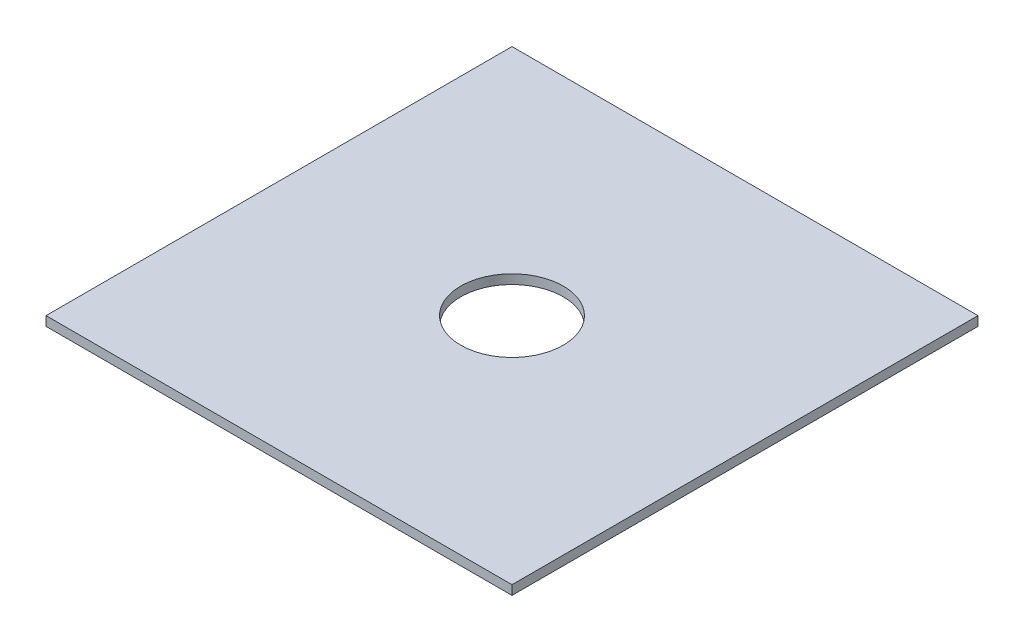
ISO-10303-21;
HEADER;
FILE_DESCRIPTION(('STEP AP214'),'2;1');
FILE_NAME('part.step','',(''),(''),'','','');
FILE_SCHEMA(('AUTOMOTIVE_DESIGN { 1 0 10303 214 1 1 1 1 }'));
ENDSEC;
DATA;
#1=APPLICATION_CONTEXT('core data for automotive mechanical design processes');
#2=APPLICATION_PROTOCOL_DEFINITION('international standard','automotive_design',2000,#1);
#3=PRODUCT_CONTEXT('',#1,'mechanical');
#4=PRODUCT('Part','Part','',(#3));
#5=PRODUCT_RELATED_PRODUCT_CATEGORY('part','',(#4));
#6=PRODUCT_DEFINITION_FORMATION('','',#4);
#7=PRODUCT_DEFINITION_CONTEXT('part definition',#1,'design');
#8=PRODUCT_DEFINITION('design','',#6,#7);
#9=PRODUCT_DEFINITION_SHAPE('','',#8);
#10=(LENGTH_UNIT() NAMED_UNIT(*) SI_UNIT(.MILLI.,.METRE.));
#11=(NAMED_UNIT(*) PLANE_ANGLE_UNIT() SI_UNIT($,.RADIAN.));
#12=(NAMED_UNIT(*) SI_UNIT($,.STERADIAN.) SOLID_ANGLE_UNIT());
#13=UNCERTAINTY_MEASURE_WITH_UNIT(LENGTH_MEASURE(1.E-05),#10,'distance_accuracy_value','');
#14=(GEOMETRIC_REPRESENTATION_CONTEXT(3) GLOBAL_UNCERTAINTY_ASSIGNED_CONTEXT((#13)) GLOBAL_UNIT_ASSIGNED_CONTEXT((#10,
#11,#12)) REPRESENTATION_CONTEXT('',''));
#15=CARTESIAN_POINT('',(0.,0.,0.));
#16=DIRECTION('',(0.,0.,1.));
#17=DIRECTION('',(1.,0.,0.));
#18=AXIS2_PLACEMENT_3D('',#15,#16,#17);
#19=CARTESIAN_POINT('',(0.,2.,0.));
#20=DIRECTION('',(0.,-1.,0.));
#21=DIRECTION('',(0.,0.,-1.));
#22=AXIS2_PLACEMENT_3D('',#19,#20,#21);
#23=PLANE('',#22);
#24=DIRECTION('',(0.,0.,-1.));
#25=VECTOR('',#24,1.);
#26=CARTESIAN_POINT('',(50.,2.,50.));
#27=LINE('',#26,#25);
#28=CARTESIAN_POINT('',(50.,2.,50.));
#29=VERTEX_POINT('',#28);
#30=CARTESIAN_POINT('',(50.,2.,-50.));
#31=VERTEX_POINT('',#30);
#32=EDGE_CURVE('E96',#29,#31,#27,.T.);
#33=ORIENTED_EDGE('',*,*,#32,.T.);
#34=DIRECTION('',(-1.,0.,0.));
#35=VECTOR('',#34,1.);
#36=CARTESIAN_POINT('',(-50.,2.,-50.));
#37=LINE('',#36,#35);
#38=CARTESIAN_POINT('',(-50.,2.,-50.));
#39=VERTEX_POINT('',#38);
#40=EDGE_CURVE('E91',#31,#39,#37,.T.);
#41=ORIENTED_EDGE('',*,*,#40,.T.);
#42=DIRECTION('',(0.,0.,1.));
#43=VECTOR('',#42,1.);
#44=CARTESIAN_POINT('',(-50.,2.,50.));
#45=LINE('',#44,#43);
#46=CARTESIAN_POINT('',(-50.,2.,50.));
#47=VERTEX_POINT('',#46);
#48=EDGE_CURVE('E94',#39,#47,#45,.T.);
#49=ORIENTED_EDGE('',*,*,#48,.T.);
#50=DIRECTION('',(1.,0.,0.));
#51=VECTOR('',#50,1.);
#52=CARTESIAN_POINT('',(-50.,2.,50.));
#53=LINE('',#52,#51);
#54=EDGE_CURVE('E61',#47,#29,#53,.T.);
#55=ORIENTED_EDGE('',*,*,#54,.T.);
#56=EDGE_LOOP('',(#33,#41,#49,#55));
#57=FACE_BOUND('',#56,.T.);
#58=CARTESIAN_POINT('',(0.,2.,0.));
#59=DIRECTION('',(0.,1.,0.));
#60=DIRECTION('',(0.,0.,1.));
#61=AXIS2_PLACEMENT_3D('',#58,#59,#60);
#62=CIRCLE('',#61,11.);
#63=CARTESIAN_POINT('',(0.,2.,11.));
#64=VERTEX_POINT('',#63);
#65=EDGE_CURVE('E116',#64,#64,#62,.T.);
#66=ORIENTED_EDGE('',*,*,#65,.F.);
#67=EDGE_LOOP('',(#66));
#68=FACE_BOUND('',#67,.T.);
#69=ADVANCED_FACE('F43',(#57,#68),#23,.F.);
#70=CARTESIAN_POINT('',(0.,0.,0.));
#71=DIRECTION('',(0.,-1.,0.));
#72=DIRECTION('',(0.,0.,-1.));
#73=AXIS2_PLACEMENT_3D('',#70,#71,#72);
#74=PLANE('',#73);
#75=DIRECTION('',(0.,0.,-1.));
#76=VECTOR('',#75,1.);
#77=CARTESIAN_POINT('',(50.,0.,50.));
#78=LINE('',#77,#76);
#79=CARTESIAN_POINT('',(50.,0.,50.));
#80=VERTEX_POINT('',#79);
#81=CARTESIAN_POINT('',(50.,0.,-50.));
#82=VERTEX_POINT('',#81);
#83=EDGE_CURVE('E112',#80,#82,#78,.T.);
#84=ORIENTED_EDGE('',*,*,#83,.F.);
#85=DIRECTION('',(1.,0.,0.));
#86=VECTOR('',#85,1.);
#87=CARTESIAN_POINT('',(-50.,0.,50.));
#88=LINE('',#87,#86);
#89=CARTESIAN_POINT('',(-50.,0.,50.));
#90=VERTEX_POINT('',#89);
#91=EDGE_CURVE('E84',#90,#80,#88,.T.);
#92=ORIENTED_EDGE('',*,*,#91,.F.);
#93=DIRECTION('',(0.,0.,1.));
#94=VECTOR('',#93,1.);
#95=CARTESIAN_POINT('',(-50.,0.,50.));
#96=LINE('',#95,#94);
#97=CARTESIAN_POINT('',(-50.,0.,-50.));
#98=VERTEX_POINT('',#97);
#99=EDGE_CURVE('E78',#98,#90,#96,.T.);
#100=ORIENTED_EDGE('',*,*,#99,.F.);
#101=DIRECTION('',(-1.,0.,0.));
#102=VECTOR('',#101,1.);
#103=CARTESIAN_POINT('',(-50.,0.,-50.));
#104=LINE('',#103,#102);
#105=EDGE_CURVE('E101',#82,#98,#104,.T.);
#106=ORIENTED_EDGE('',*,*,#105,.F.);
#107=EDGE_LOOP('',(#84,#92,#100,#106));
#108=FACE_BOUND('',#107,.T.);
#109=CARTESIAN_POINT('',(0.,0.,0.));
#110=DIRECTION('',(0.,1.,0.));
#111=DIRECTION('',(0.,0.,1.));
#112=AXIS2_PLACEMENT_3D('',#109,#110,#111);
#113=CIRCLE('',#112,11.);
#114=CARTESIAN_POINT('',(0.,0.,11.));
#115=VERTEX_POINT('',#114);
#116=EDGE_CURVE('E134',#115,#115,#113,.T.);
#117=ORIENTED_EDGE('',*,*,#116,.T.);
#118=EDGE_LOOP('',(#117));
#119=FACE_BOUND('',#118,.T.);
#120=ADVANCED_FACE('F129',(#108,#119),#74,.T.);
#121=CARTESIAN_POINT('',(50.,2.,50.));
#122=DIRECTION('',(-1.,0.,0.));
#123=DIRECTION('',(0.,0.,1.));
#124=AXIS2_PLACEMENT_3D('',#121,#122,#123);
#125=PLANE('',#124);
#126=ORIENTED_EDGE('',*,*,#83,.T.);
#127=DIRECTION('',(0.,-1.,0.));
#128=VECTOR('',#127,1.);
#129=CARTESIAN_POINT('',(50.,2.,-50.));
#130=LINE('',#129,#128);
#131=EDGE_CURVE('E11',#31,#82,#130,.T.);
#132=ORIENTED_EDGE('',*,*,#131,.F.);
#133=ORIENTED_EDGE('',*,*,#32,.F.);
#134=DIRECTION('',(0.,-1.,0.));
#135=VECTOR('',#134,1.);
#136=CARTESIAN_POINT('',(50.,2.,50.));
#137=LINE('',#136,#135);
#138=EDGE_CURVE('E108',#29,#80,#137,.T.);
#139=ORIENTED_EDGE('',*,*,#138,.T.);
#140=EDGE_LOOP('',(#126,#132,#133,#139));
#141=FACE_BOUND('',#140,.T.);
#142=ADVANCED_FACE('F45',(#141),#125,.F.);
#143=CARTESIAN_POINT('',(-50.,2.,-50.));
#144=DIRECTION('',(0.,0.,1.));
#145=DIRECTION('',(1.,0.,0.));
#146=AXIS2_PLACEMENT_3D('',#143,#144,#145);
#147=PLANE('',#146);
#148=ORIENTED_EDGE('',*,*,#105,.T.);
#149=DIRECTION('',(0.,-1.,0.));
#150=VECTOR('',#149,1.);
#151=CARTESIAN_POINT('',(-50.,2.,-50.));
#152=LINE('',#151,#150);
#153=EDGE_CURVE('E53',#39,#98,#152,.T.);
#154=ORIENTED_EDGE('',*,*,#153,.F.);
#155=ORIENTED_EDGE('',*,*,#40,.F.);
#156=ORIENTED_EDGE('',*,*,#131,.T.);
#157=EDGE_LOOP('',(#148,#154,#155,#156));
#158=FACE_BOUND('',#157,.T.);
#159=ADVANCED_FACE('F100',(#158),#147,.F.);
#160=CARTESIAN_POINT('',(-50.,2.,50.));
#161=DIRECTION('',(1.,0.,0.));
#162=DIRECTION('',(0.,0.,-1.));
#163=AXIS2_PLACEMENT_3D('',#160,#161,#162);
#164=PLANE('',#163);
#165=ORIENTED_EDGE('',*,*,#99,.T.);
#166=DIRECTION('',(0.,-1.,0.));
#167=VECTOR('',#166,1.);
#168=CARTESIAN_POINT('',(-50.,2.,50.));
#169=LINE('',#168,#167);
#170=EDGE_CURVE('E103',#47,#90,#169,.T.);
#171=ORIENTED_EDGE('',*,*,#170,.F.);
#172=ORIENTED_EDGE('',*,*,#48,.F.);
#173=ORIENTED_EDGE('',*,*,#153,.T.);
#174=EDGE_LOOP('',(#165,#171,#172,#173));
#175=FACE_BOUND('',#174,.T.);
#176=ADVANCED_FACE('F104',(#175),#164,.F.);
#177=CARTESIAN_POINT('',(-50.,2.,50.));
#178=DIRECTION('',(0.,0.,-1.));
#179=DIRECTION('',(-1.,0.,0.));
#180=AXIS2_PLACEMENT_3D('',#177,#178,#179);
#181=PLANE('',#180);
#182=ORIENTED_EDGE('',*,*,#91,.T.);
#183=ORIENTED_EDGE('',*,*,#138,.F.);
#184=ORIENTED_EDGE('',*,*,#54,.F.);
#185=ORIENTED_EDGE('',*,*,#170,.T.);
#186=EDGE_LOOP('',(#182,#183,#184,#185));
#187=FACE_BOUND('',#186,.T.);
#188=ADVANCED_FACE('F126',(#187),#181,.F.);
#189=CARTESIAN_POINT('',(0.,2.,0.));
#190=DIRECTION('',(0.,-1.,0.));
#191=DIRECTION('',(0.,0.,-1.));
#192=AXIS2_PLACEMENT_3D('',#189,#190,#191);
#193=CYLINDRICAL_SURFACE('',#192,11.);
#194=ORIENTED_EDGE('',*,*,#65,.T.);
#195=EDGE_LOOP('',(#194));
#196=FACE_BOUND('',#195,.T.);
#197=ORIENTED_EDGE('',*,*,#116,.F.);
#198=EDGE_LOOP('',(#197));
#199=FACE_BOUND('',#198,.T.);
#200=ADVANCED_FACE('F142',(#196,#199),#193,.F.);
#201=CLOSED_SHELL('',(#69,#120,#142,#159,#176,#188,#200));
#202=MANIFOLD_SOLID_BREP('B2',#201);
#203=ADVANCED_BREP_SHAPE_REPRESENTATION('',(#18,#202),#14);
#204=SHAPE_DEFINITION_REPRESENTATION(#9,#203);
ENDSEC;
END-ISO-10303-21;
